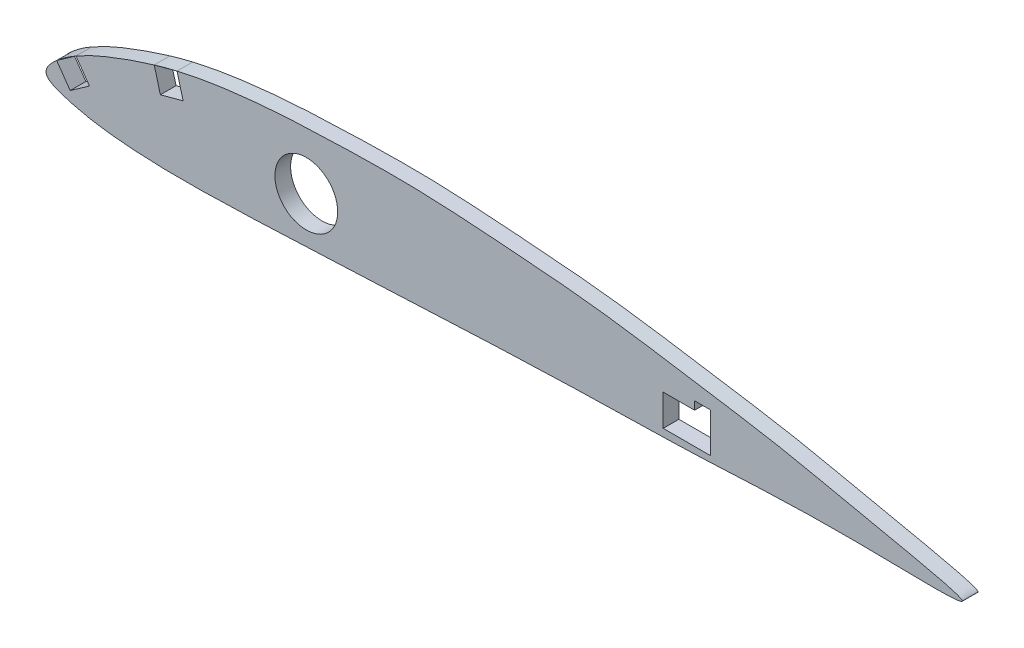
from build123d import *

# Parameters (mm, degrees)
BOSS_EXTRUDE1_DEPTH = 3.175
SKETCH1_R           = 6.35
CUT_EXTRUDE1_DEPTH  = 10


with BuildPart() as part:
    # 3DSketch1 → Boss-Extrude1 (new body)
    with BuildSketch(Plane(origin=(0, 0, 0), x_dir=(0.999981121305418, -0.006144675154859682, 0), z_dir=(0, 0, 1))):
        with BuildLine():
            add(Edge.make_bspline(
                [(0, 0), (-0.057126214, 0.990782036), (2.093370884, 3.22890439), (5.153630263, 5.449262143), (9.124304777, 7.619012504), (16.734467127, 10.769247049), (25.971032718, 13.778872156), (36.915225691, 15.598079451), (46.194494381, 16.581741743), (58.550505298, 17.175661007), (74.012351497, 17.709305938), (92.529199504, 16.52400805), (111.180623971, 15.185940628), (129.41804303, 12.379273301), (148.980982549, 9.511483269), (163.918249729, 6.094141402), (195.707620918, 0), (154.616539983, 1.194571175), (136.760914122, -0.550202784), (98.197479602, -1.395158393), (68.059746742, -3.223131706), (37.028193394, -4.766863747), (21.775294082, -5.110728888), (10.540606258, -4.092256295), (4.816565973, -2.820418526), (0.078392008, -1.359610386), (0, 0)],
                knots=[0, 0, 0, 0, 0.010560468, 0.018211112, 0.032209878, 0.045524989, 0.084069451, 0.108974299, 0.133649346, 0.158232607, 0.207343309, 0.256522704, 0.305826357, 0.355445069, 0.405214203, 0.45539047, 0.506006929, 0.555121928, 0.653369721, 0.702490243, 0.849938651, 0.899083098, 0.948194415, 0.97290595, 0.985508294, 1, 1, 1, 1], degree=3))
        make_face()
    extrude(amount=BOSS_EXTRUDE1_DEPTH)

    # Sketch1 → Cut-Extrude1 (cut)
    with BuildSketch(Plane.XY.offset(3.175)):
        with Locations((52.625, 5)):
            Circle(SKETCH1_R)
        Polygon((2.15747214, 3.103775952), (6.058683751, 5.83543373), (8.790341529, 1.934222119), (4.889129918, -0.797435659), align=None)
        Polygon((131.132, 8), (134.307, 8), (134.307, 0), (131.132, 0), (124.782, 0), (124.782, 6.35), (131.132, 6.35), align=None)
        Polygon((21.887792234, 12.177081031), (26.488013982, 13.409706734), (27.720639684, 8.809484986), (23.120417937, 7.576859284), align=None)
    extrude(amount=-CUT_EXTRUDE1_DEPTH, mode=Mode.SUBTRACT)


solid = part.part
